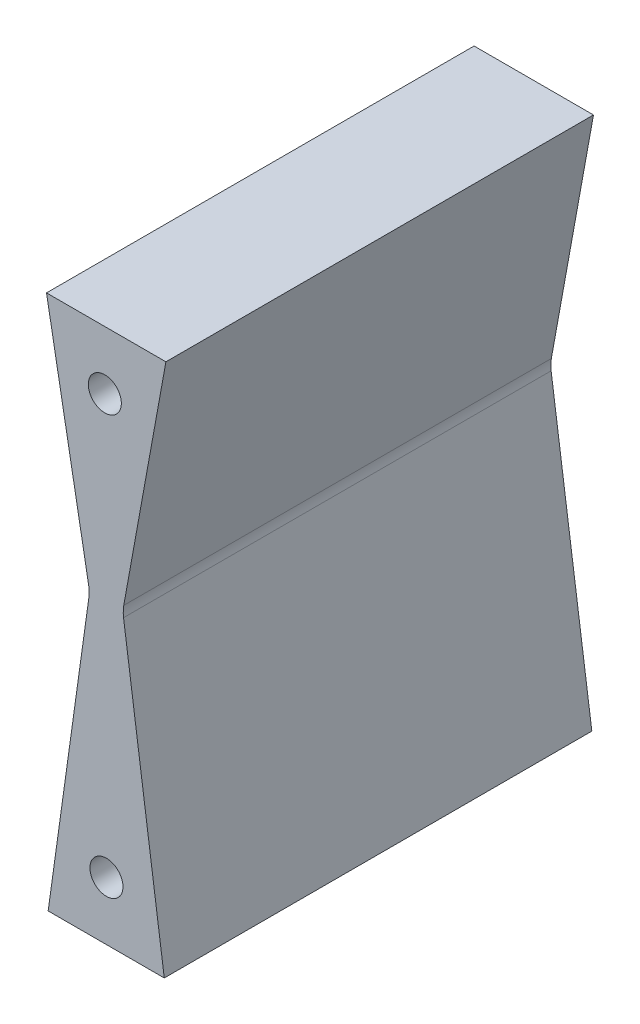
from build123d import *

# Parameters (mm, degrees)
BASE_EXTRUSION_DEPTH       = 88
TROU_TARAUD_M8X1_251_D     = 6.8
TROU_TARAUD_M8X1_251_DEPTH = 30
TROU_TARAUD_M8X1_251_TIP   = 2.042926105


with BuildPart() as part:
    # Esquisse1 → Base-Extrusion (new body)
    with BuildSketch(Plane.XY):
        with BuildLine():
            Line((-40.551704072, -157.5), (-48.932763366, -97.467880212))
            ThreePointArc((-48.932763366, -97.467880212), (-48.998530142, -96.356557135), (-48.887282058, -95.248862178))
            Line((-48.887282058, -95.248862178), (-40.213264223, -47.5))
            Line((-40.213264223, -47.5), (-64.786735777, -47.5))
            Line((-64.786735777, -47.5), (-56.112717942, -95.248862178))
            ThreePointArc((-56.112717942, -95.248862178), (-56.001469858, -96.356557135), (-56.067236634, -97.467880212))
            Line((-56.067236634, -97.467880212), (-64.448295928, -157.5))
            Line((-64.448295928, -157.5), (-40.551704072, -157.5))
        make_face()
    extrude(amount=-BASE_EXTRUSION_DEPTH)

    # Trou taraud_ M8x1.251
    with Locations(Plane.XY):
        with Locations((-52.786735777, -59.5), (-52.448295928, -145.5)):
            Hole(TROU_TARAUD_M8X1_251_D / 2, depth=TROU_TARAUD_M8X1_251_DEPTH)
            with Locations((0, 0, -(TROU_TARAUD_M8X1_251_DEPTH + TROU_TARAUD_M8X1_251_TIP / 2))):  # 118° drill point
                Cone(0, TROU_TARAUD_M8X1_251_D / 2, TROU_TARAUD_M8X1_251_TIP, mode=Mode.SUBTRACT)


solid = part.part
